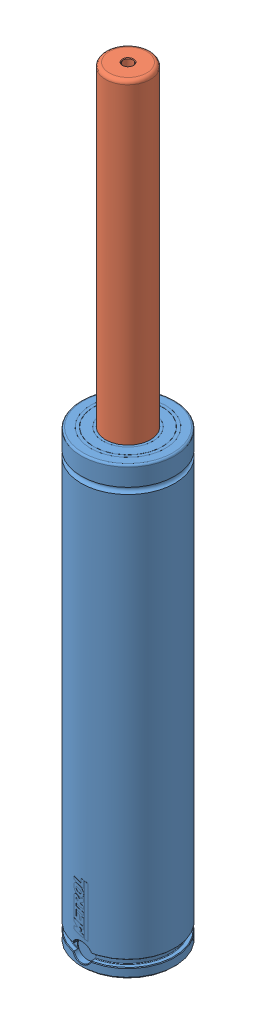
SolidWorks assembly ISNG1500-250.SLDASM, configuration Default (file format 7000). Lengths in mm.
Overall size (75 610 75.11).
2 component instances, 2 part files, 5 mates.
Components (placement in the parent):
- ISNG-1500 Body-1: ISNG-1500 Body.SLDPRT [ISNG-1500-250] x (0 0 1) z (0 -1 0) size (75.11 75 357)
- ISNG-1500 Piston-1: ISNG-1500 Piston.SLDPRT [ISNG-1500-250] at (0 332 0) x (-0.058581 0 0.998283) z (0 -1 0) size (50 50 278)
Mates (geometry in assembly coordinates):
- Concentric1: concentric aligned: cylinder of ISNG-1500 Body-1 through (0 0 0) axis (0 -1 0) radius 18; cylinder of ISNG-1500 Piston-1 through (0 332 0) axis (0 -1 0) radius 18
- LimitDistance1: limit distance anti-aligned: plane of ISNG-1500 Body-1 through (-18 337 0) normal (0 -1 0); plane of ISNG-1500 Piston-1 through (-24.9571 337 -1.4645) normal (0 1 0)
- Coincident1: coincident anti-aligned: plane of ISNG-1500 Body-1 through (0 0 0) normal (0 -1 0); plane of assembly through (0 0 0) normal (0 1 0)
- Coincident2: coincident aligned: plane of ISNG-1500 Body-1; plane of assembly through (0 0 0) normal (0 0 1)
- Coincident3: coincident anti-aligned: plane of ISNG-1500 Body-1; plane of assembly through (0 0 0) normal (1 0 0)
